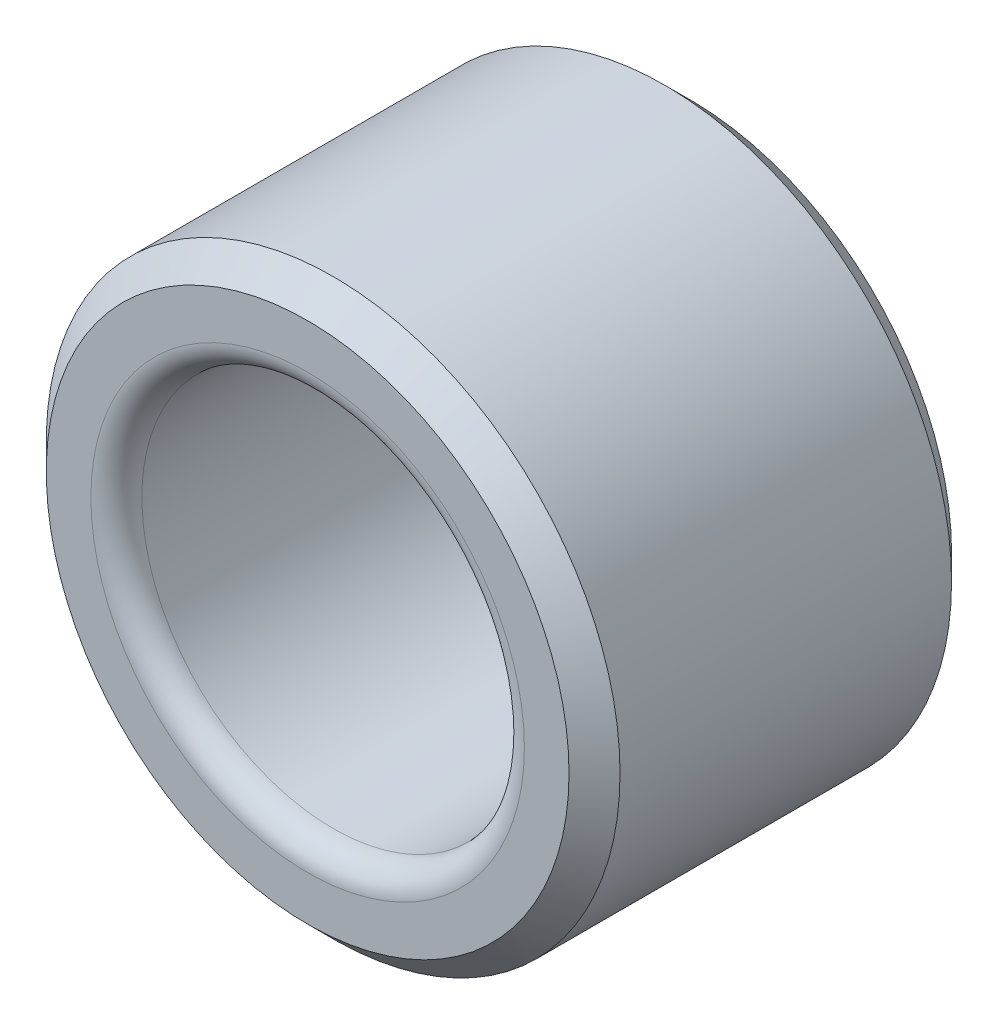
ISO-10303-21;
HEADER;
FILE_DESCRIPTION(('STEP AP214'),'2;1');
FILE_NAME('part.step','',(''),(''),'','','');
FILE_SCHEMA(('AUTOMOTIVE_DESIGN { 1 0 10303 214 1 1 1 1 }'));
ENDSEC;
DATA;
#1=APPLICATION_CONTEXT('core data for automotive mechanical design processes');
#2=APPLICATION_PROTOCOL_DEFINITION('international standard','automotive_design',2000,#1);
#3=PRODUCT_CONTEXT('',#1,'mechanical');
#4=PRODUCT('Part','Part','',(#3));
#5=PRODUCT_RELATED_PRODUCT_CATEGORY('part','',(#4));
#6=PRODUCT_DEFINITION_FORMATION('','',#4);
#7=PRODUCT_DEFINITION_CONTEXT('part definition',#1,'design');
#8=PRODUCT_DEFINITION('design','',#6,#7);
#9=PRODUCT_DEFINITION_SHAPE('','',#8);
#10=(LENGTH_UNIT() NAMED_UNIT(*) SI_UNIT(.MILLI.,.METRE.));
#11=(NAMED_UNIT(*) PLANE_ANGLE_UNIT() SI_UNIT($,.RADIAN.));
#12=(NAMED_UNIT(*) SI_UNIT($,.STERADIAN.) SOLID_ANGLE_UNIT());
#13=UNCERTAINTY_MEASURE_WITH_UNIT(LENGTH_MEASURE(1.E-05),#10,'distance_accuracy_value','');
#14=(GEOMETRIC_REPRESENTATION_CONTEXT(3) GLOBAL_UNCERTAINTY_ASSIGNED_CONTEXT((#13)) GLOBAL_UNIT_ASSIGNED_CONTEXT((#10,
#11,#12)) REPRESENTATION_CONTEXT('',''));
#15=CARTESIAN_POINT('',(0.,0.,0.));
#16=DIRECTION('',(0.,0.,1.));
#17=DIRECTION('',(1.,0.,0.));
#18=AXIS2_PLACEMENT_3D('',#15,#16,#17);
#19=CARTESIAN_POINT('',(0.,0.,12.));
#20=DIRECTION('',(0.,0.,1.));
#21=DIRECTION('',(1.,0.,0.));
#22=AXIS2_PLACEMENT_3D('',#19,#20,#21);
#23=PLANE('',#22);
#24=CARTESIAN_POINT('',(0.,0.,12.));
#25=DIRECTION('',(0.,0.,1.));
#26=DIRECTION('',(1.,0.,0.));
#27=AXIS2_PLACEMENT_3D('',#24,#25,#26);
#28=CIRCLE('',#27,6.8);
#29=CARTESIAN_POINT('',(6.8,0.,12.));
#30=VERTEX_POINT('',#29);
#31=EDGE_CURVE('E37',#30,#30,#28,.F.);
#32=ORIENTED_EDGE('',*,*,#31,.T.);
#33=EDGE_LOOP('',(#32));
#34=FACE_BOUND('',#33,.T.);
#35=CARTESIAN_POINT('',(0.,0.,12.));
#36=DIRECTION('',(0.,0.,1.));
#37=DIRECTION('',(1.,0.,0.));
#38=AXIS2_PLACEMENT_3D('',#35,#36,#37);
#39=CIRCLE('',#38,8.20000000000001);
#40=CARTESIAN_POINT('',(8.20000000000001,0.,12.));
#41=VERTEX_POINT('',#40);
#42=EDGE_CURVE('E59',#41,#41,#39,.T.);
#43=ORIENTED_EDGE('',*,*,#42,.T.);
#44=EDGE_LOOP('',(#43));
#45=FACE_BOUND('',#44,.T.);
#46=ADVANCED_FACE('F30',(#34,#45),#23,.T.);
#47=CARTESIAN_POINT('',(0.,0.,0.));
#48=DIRECTION('',(0.,0.,1.));
#49=DIRECTION('',(1.,0.,0.));
#50=AXIS2_PLACEMENT_3D('',#47,#48,#49);
#51=PLANE('',#50);
#52=CARTESIAN_POINT('',(0.,0.,0.));
#53=DIRECTION('',(0.,0.,1.));
#54=DIRECTION('',(1.,0.,0.));
#55=AXIS2_PLACEMENT_3D('',#52,#53,#54);
#56=CIRCLE('',#55,6.8);
#57=CARTESIAN_POINT('',(6.8,0.,0.));
#58=VERTEX_POINT('',#57);
#59=EDGE_CURVE('E10',#58,#58,#56,.T.);
#60=ORIENTED_EDGE('',*,*,#59,.T.);
#61=EDGE_LOOP('',(#60));
#62=FACE_BOUND('',#61,.T.);
#63=CARTESIAN_POINT('',(0.,0.,0.));
#64=DIRECTION('',(0.,0.,1.));
#65=DIRECTION('',(1.,0.,0.));
#66=AXIS2_PLACEMENT_3D('',#63,#64,#65);
#67=CIRCLE('',#66,8.2);
#68=CARTESIAN_POINT('',(8.2,0.,0.));
#69=VERTEX_POINT('',#68);
#70=EDGE_CURVE('E50',#69,#69,#67,.F.);
#71=ORIENTED_EDGE('',*,*,#70,.T.);
#72=EDGE_LOOP('',(#71));
#73=FACE_BOUND('',#72,.T.);
#74=ADVANCED_FACE('F83',(#62,#73),#51,.F.);
#75=CARTESIAN_POINT('',(0.,0.,12.));
#76=DIRECTION('',(0.,0.,-1.));
#77=DIRECTION('',(-1.,0.,0.));
#78=AXIS2_PLACEMENT_3D('',#75,#76,#77);
#79=CYLINDRICAL_SURFACE('',#78,9.);
#80=CARTESIAN_POINT('',(0.,0.,11.2));
#81=DIRECTION('',(0.,0.,1.));
#82=DIRECTION('',(1.,0.,0.));
#83=AXIS2_PLACEMENT_3D('',#80,#81,#82);
#84=CIRCLE('',#83,9.);
#85=CARTESIAN_POINT('',(9.,0.,11.2));
#86=VERTEX_POINT('',#85);
#87=EDGE_CURVE('E53',#86,#86,#84,.F.);
#88=ORIENTED_EDGE('',*,*,#87,.T.);
#89=EDGE_LOOP('',(#88));
#90=FACE_BOUND('',#89,.T.);
#91=CARTESIAN_POINT('',(0.,0.,0.799999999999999));
#92=DIRECTION('',(0.,0.,1.));
#93=DIRECTION('',(1.,0.,0.));
#94=AXIS2_PLACEMENT_3D('',#91,#92,#93);
#95=CIRCLE('',#94,9.);
#96=CARTESIAN_POINT('',(9.,0.,0.799999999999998));
#97=VERTEX_POINT('',#96);
#98=EDGE_CURVE('E56',#97,#97,#95,.T.);
#99=ORIENTED_EDGE('',*,*,#98,.T.);
#100=EDGE_LOOP('',(#99));
#101=FACE_BOUND('',#100,.T.);
#102=ADVANCED_FACE('F77',(#90,#101),#79,.T.);
#103=CARTESIAN_POINT('',(0.,0.,12.));
#104=DIRECTION('',(0.,0.,-1.));
#105=DIRECTION('',(-1.,0.,0.));
#106=AXIS2_PLACEMENT_3D('',#103,#104,#105);
#107=CYLINDRICAL_SURFACE('',#106,6.);
#108=CARTESIAN_POINT('',(0.,0.,11.2));
#109=DIRECTION('',(0.,0.,1.));
#110=DIRECTION('',(1.,0.,0.));
#111=AXIS2_PLACEMENT_3D('',#108,#109,#110);
#112=CIRCLE('',#111,6.);
#113=CARTESIAN_POINT('',(6.,0.,11.2));
#114=VERTEX_POINT('',#113);
#115=EDGE_CURVE('E41',#114,#114,#112,.T.);
#116=ORIENTED_EDGE('',*,*,#115,.T.);
#117=EDGE_LOOP('',(#116));
#118=FACE_BOUND('',#117,.T.);
#119=CARTESIAN_POINT('',(0.,0.,0.8));
#120=DIRECTION('',(0.,0.,1.));
#121=DIRECTION('',(1.,0.,0.));
#122=AXIS2_PLACEMENT_3D('',#119,#120,#121);
#123=CIRCLE('',#122,6.);
#124=CARTESIAN_POINT('',(6.,0.,0.8));
#125=VERTEX_POINT('',#124);
#126=EDGE_CURVE('E45',#125,#125,#123,.F.);
#127=ORIENTED_EDGE('',*,*,#126,.T.);
#128=EDGE_LOOP('',(#127));
#129=FACE_BOUND('',#128,.T.);
#130=ADVANCED_FACE('F67',(#118,#129),#107,.F.);
#131=CARTESIAN_POINT('',(0.,0.,12.));
#132=DIRECTION('',(0.,0.,-1.));
#133=DIRECTION('',(-1.,0.,0.));
#134=AXIS2_PLACEMENT_3D('',#131,#132,#133);
#135=CONICAL_SURFACE('',#134,8.20000000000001,0.785398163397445);
#136=ORIENTED_EDGE('',*,*,#87,.F.);
#137=EDGE_LOOP('',(#136));
#138=FACE_BOUND('',#137,.T.);
#139=ORIENTED_EDGE('',*,*,#42,.F.);
#140=EDGE_LOOP('',(#139));
#141=FACE_BOUND('',#140,.T.);
#142=ADVANCED_FACE('F64',(#138,#141),#135,.T.);
#143=CARTESIAN_POINT('',(0.,0.,0.799999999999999));
#144=DIRECTION('',(0.,0.,1.));
#145=DIRECTION('',(1.,0.,0.));
#146=AXIS2_PLACEMENT_3D('',#143,#144,#145);
#147=CONICAL_SURFACE('',#146,9.,0.785398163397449);
#148=CARTESIAN_POINT('',(8.2,0.,0.));
#149=CARTESIAN_POINT('',(8.20833333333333,0.,0.00833333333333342));
#150=CARTESIAN_POINT('',(8.21666666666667,0.,0.0166666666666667));
#151=CARTESIAN_POINT('',(8.23333333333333,0.,0.0333333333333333));
#152=CARTESIAN_POINT('',(8.24166666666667,0.,0.0416666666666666));
#153=CARTESIAN_POINT('',(8.25833333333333,0.,0.058333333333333));
#154=CARTESIAN_POINT('',(8.26666666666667,0.,0.0666666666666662));
#155=CARTESIAN_POINT('',(8.28333333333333,0.,0.083333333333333));
#156=CARTESIAN_POINT('',(8.29166666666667,0.,0.0916666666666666));
#157=CARTESIAN_POINT('',(8.30833333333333,0.,0.108333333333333));
#158=CARTESIAN_POINT('',(8.31666666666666,0.,0.116666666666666));
#159=CARTESIAN_POINT('',(8.33333333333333,0.,0.133333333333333));
#160=CARTESIAN_POINT('',(8.34166666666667,0.,0.141666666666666));
#161=CARTESIAN_POINT('',(8.35833333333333,0.,0.158333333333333));
#162=CARTESIAN_POINT('',(8.36666666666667,0.,0.166666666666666));
#163=CARTESIAN_POINT('',(8.38333333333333,0.,0.183333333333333));
#164=CARTESIAN_POINT('',(8.39166666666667,0.,0.191666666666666));
#165=CARTESIAN_POINT('',(8.40833333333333,0.,0.208333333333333));
#166=CARTESIAN_POINT('',(8.41666666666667,0.,0.216666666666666));
#167=CARTESIAN_POINT('',(8.43333333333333,0.,0.233333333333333));
#168=CARTESIAN_POINT('',(8.44166666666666,0.,0.241666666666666));
#169=CARTESIAN_POINT('',(8.45833333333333,0.,0.258333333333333));
#170=CARTESIAN_POINT('',(8.46666666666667,0.,0.266666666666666));
#171=CARTESIAN_POINT('',(8.48333333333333,0.,0.283333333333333));
#172=CARTESIAN_POINT('',(8.49166666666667,0.,0.291666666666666));
#173=CARTESIAN_POINT('',(8.50833333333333,0.,0.308333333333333));
#174=CARTESIAN_POINT('',(8.51666666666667,0.,0.316666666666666));
#175=CARTESIAN_POINT('',(8.53333333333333,0.,0.333333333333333));
#176=CARTESIAN_POINT('',(8.54166666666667,0.,0.341666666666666));
#177=CARTESIAN_POINT('',(8.55833333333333,0.,0.358333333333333));
#178=CARTESIAN_POINT('',(8.56666666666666,0.,0.366666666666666));
#179=CARTESIAN_POINT('',(8.58333333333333,0.,0.383333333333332));
#180=CARTESIAN_POINT('',(8.59166666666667,0.,0.391666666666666));
#181=CARTESIAN_POINT('',(8.60833333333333,0.,0.408333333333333));
#182=CARTESIAN_POINT('',(8.61666666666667,0.,0.416666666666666));
#183=CARTESIAN_POINT('',(8.63333333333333,0.,0.433333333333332));
#184=CARTESIAN_POINT('',(8.64166666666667,0.,0.441666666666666));
#185=CARTESIAN_POINT('',(8.65833333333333,0.,0.458333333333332));
#186=CARTESIAN_POINT('',(8.66666666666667,0.,0.466666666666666));
#187=CARTESIAN_POINT('',(8.68333333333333,0.,0.483333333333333));
#188=CARTESIAN_POINT('',(8.69166666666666,0.,0.491666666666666));
#189=CARTESIAN_POINT('',(8.70833333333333,0.,0.508333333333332));
#190=CARTESIAN_POINT('',(8.71666666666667,0.,0.516666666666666));
#191=CARTESIAN_POINT('',(8.73333333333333,0.,0.533333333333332));
#192=CARTESIAN_POINT('',(8.74166666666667,0.,0.541666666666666));
#193=CARTESIAN_POINT('',(8.75833333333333,0.,0.558333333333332));
#194=CARTESIAN_POINT('',(8.76666666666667,0.,0.566666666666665));
#195=CARTESIAN_POINT('',(8.78333333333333,0.,0.583333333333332));
#196=CARTESIAN_POINT('',(8.79166666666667,0.,0.591666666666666));
#197=CARTESIAN_POINT('',(8.80833333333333,0.,0.608333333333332));
#198=CARTESIAN_POINT('',(8.81666666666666,0.,0.616666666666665));
#199=CARTESIAN_POINT('',(8.83333333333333,0.,0.633333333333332));
#200=CARTESIAN_POINT('',(8.84166666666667,0.,0.641666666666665));
#201=CARTESIAN_POINT('',(8.85833333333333,0.,0.658333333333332));
#202=CARTESIAN_POINT('',(8.86666666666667,0.,0.666666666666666));
#203=CARTESIAN_POINT('',(8.88333333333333,0.,0.683333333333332));
#204=CARTESIAN_POINT('',(8.89166666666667,0.,0.691666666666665));
#205=CARTESIAN_POINT('',(8.90833333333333,0.,0.708333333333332));
#206=CARTESIAN_POINT('',(8.91666666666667,0.,0.716666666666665));
#207=CARTESIAN_POINT('',(8.93333333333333,0.,0.733333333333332));
#208=CARTESIAN_POINT('',(8.94166666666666,0.,0.741666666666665));
#209=CARTESIAN_POINT('',(8.95833333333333,0.,0.758333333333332));
#210=CARTESIAN_POINT('',(8.96666666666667,0.,0.766666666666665));
#211=CARTESIAN_POINT('',(8.98333333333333,0.,0.783333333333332));
#212=CARTESIAN_POINT('',(8.99166666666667,0.,0.791666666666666));
#213=CARTESIAN_POINT('',(9.,0.,0.799999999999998));
#214=B_SPLINE_CURVE_WITH_KNOTS('',3,(#148,#149,#150,#151,#152,#153,#154,#155,#156,#157,#158,
#159,#160,#161,#162,#163,#164,#165,#166,#167,#168,#169,#170,#171,#172,#173,#174,#175,#176,#177,
#178,#179,#180,#181,#182,#183,#184,#185,#186,#187,#188,#189,#190,#191,#192,#193,#194,#195,#196,
#197,#198,#199,#200,#201,#202,#203,#204,#205,#206,#207,#208,#209,#210,#211,#212,#213),
.UNSPECIFIED.,.F.,.F.,(4,2,2,2,2,2,2,2,2,2,2,2,2,2,2,2,2,2,2,2,2,2,2,2,2,2,2,2,2,2,2,2,4),(0.,
0.0353553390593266,0.0707106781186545,0.106066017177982,0.141421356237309,0.176776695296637,
0.212132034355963,0.247487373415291,0.282842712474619,0.318198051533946,0.353553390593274,
0.3889087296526,0.424264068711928,0.459619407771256,0.494974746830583,0.53033008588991,
0.565685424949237,0.601040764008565,0.636396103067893,0.67175144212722,0.707106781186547,
0.742462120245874,0.777817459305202,0.81317279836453,0.848528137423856,0.883883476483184,
0.919238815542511,0.954594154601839,0.989949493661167,1.02530483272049,1.06066017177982,
1.09601551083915,1.13137084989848),.UNSPECIFIED.);
#215=EDGE_CURVE('BSEAM66',#69,#97,#214,.T.);
#216=ORIENTED_EDGE('',*,*,#70,.F.);
#217=ORIENTED_EDGE('',*,*,#98,.F.);
#218=ORIENTED_EDGE('',*,*,#215,.T.);
#219=ORIENTED_EDGE('',*,*,#215,.F.);
#220=EDGE_LOOP('',(#216,#218,#217,#219));
#221=FACE_BOUND('',#220,.T.);
#222=ADVANCED_FACE('F66',(#221),#147,.T.);
#223=CARTESIAN_POINT('',(0.,0.,11.2));
#224=DIRECTION('',(0.,0.,1.));
#225=DIRECTION('',(1.,0.,0.));
#226=AXIS2_PLACEMENT_3D('',#223,#224,#225);
#227=TOROIDAL_SURFACE('',#226,6.8,0.8);
#228=ORIENTED_EDGE('',*,*,#31,.F.);
#229=EDGE_LOOP('',(#228));
#230=FACE_BOUND('',#229,.T.);
#231=ORIENTED_EDGE('',*,*,#115,.F.);
#232=EDGE_LOOP('',(#231));
#233=FACE_BOUND('',#232,.T.);
#234=ADVANCED_FACE('F74',(#230,#233),#227,.T.);
#235=CARTESIAN_POINT('',(0.,0.,0.8));
#236=DIRECTION('',(0.,0.,1.));
#237=DIRECTION('',(1.,0.,0.));
#238=AXIS2_PLACEMENT_3D('',#235,#236,#237);
#239=TOROIDAL_SURFACE('',#238,6.8,0.8);
#240=ORIENTED_EDGE('',*,*,#126,.F.);
#241=EDGE_LOOP('',(#240));
#242=FACE_BOUND('',#241,.T.);
#243=ORIENTED_EDGE('',*,*,#59,.F.);
#244=EDGE_LOOP('',(#243));
#245=FACE_BOUND('',#244,.T.);
#246=ADVANCED_FACE('F32',(#242,#245),#239,.T.);
#247=CLOSED_SHELL('',(#46,#74,#102,#130,#142,#222,#234,#246));
#248=MANIFOLD_SOLID_BREP('B2',#247);
#249=ADVANCED_BREP_SHAPE_REPRESENTATION('',(#18,#248),#14);
#250=SHAPE_DEFINITION_REPRESENTATION(#9,#249);
ENDSEC;
END-ISO-10303-21;
